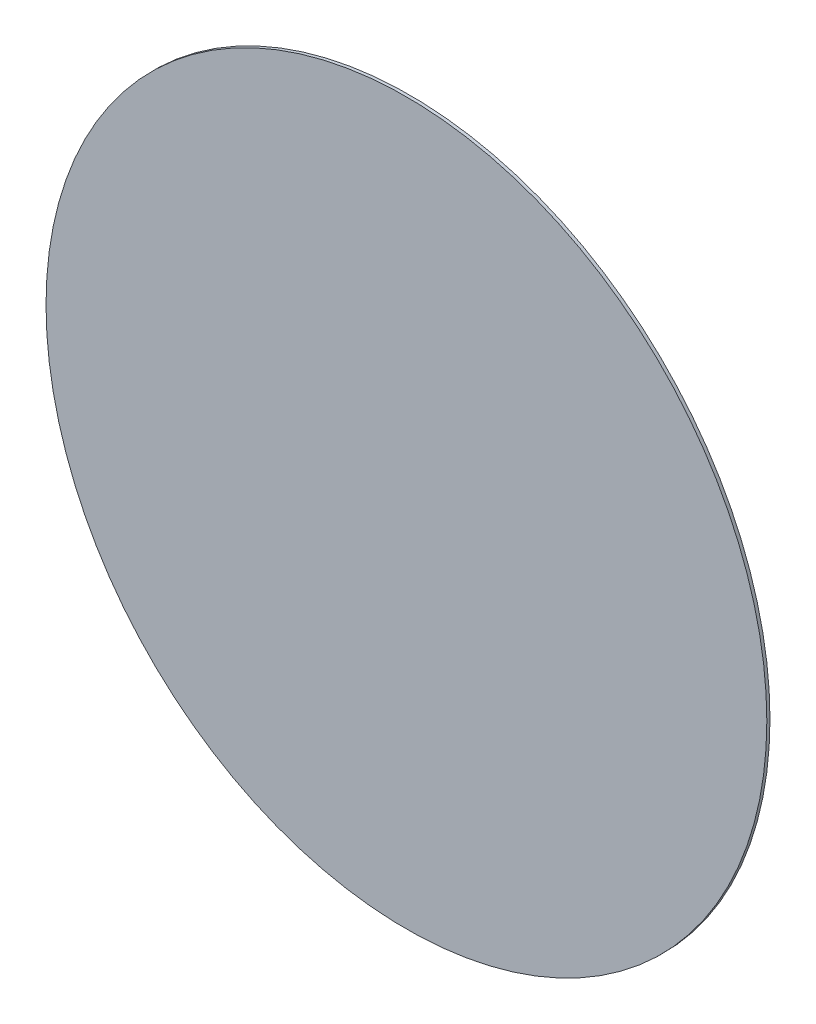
ISO-10303-21;
HEADER;
FILE_DESCRIPTION(('STEP AP214'),'2;1');
FILE_NAME('part.step','',(''),(''),'','','');
FILE_SCHEMA(('AUTOMOTIVE_DESIGN { 1 0 10303 214 1 1 1 1 }'));
ENDSEC;
DATA;
#1=APPLICATION_CONTEXT('core data for automotive mechanical design processes');
#2=APPLICATION_PROTOCOL_DEFINITION('international standard','automotive_design',2000,#1);
#3=PRODUCT_CONTEXT('',#1,'mechanical');
#4=PRODUCT('Part','Part','',(#3));
#5=PRODUCT_RELATED_PRODUCT_CATEGORY('part','',(#4));
#6=PRODUCT_DEFINITION_FORMATION('','',#4);
#7=PRODUCT_DEFINITION_CONTEXT('part definition',#1,'design');
#8=PRODUCT_DEFINITION('design','',#6,#7);
#9=PRODUCT_DEFINITION_SHAPE('','',#8);
#10=(LENGTH_UNIT() NAMED_UNIT(*) SI_UNIT(.MILLI.,.METRE.));
#11=(NAMED_UNIT(*) PLANE_ANGLE_UNIT() SI_UNIT($,.RADIAN.));
#12=(NAMED_UNIT(*) SI_UNIT($,.STERADIAN.) SOLID_ANGLE_UNIT());
#13=UNCERTAINTY_MEASURE_WITH_UNIT(LENGTH_MEASURE(1.E-05),#10,'distance_accuracy_value','');
#14=(GEOMETRIC_REPRESENTATION_CONTEXT(3) GLOBAL_UNCERTAINTY_ASSIGNED_CONTEXT((#13)) GLOBAL_UNIT_ASSIGNED_CONTEXT((#10,
#11,#12)) REPRESENTATION_CONTEXT('',''));
#15=CARTESIAN_POINT('',(0.,0.,0.));
#16=DIRECTION('',(0.,0.,1.));
#17=DIRECTION('',(1.,0.,0.));
#18=AXIS2_PLACEMENT_3D('',#15,#16,#17);
#19=CARTESIAN_POINT('',(0.,0.,0.10922));
#20=DIRECTION('',(0.,0.,-1.));
#21=DIRECTION('',(-1.,0.,0.));
#22=AXIS2_PLACEMENT_3D('',#19,#20,#21);
#23=CYLINDRICAL_SURFACE('',#22,12.5);
#24=CARTESIAN_POINT('',(0.,0.,0.10922));
#25=DIRECTION('',(0.,0.,1.));
#26=DIRECTION('',(1.,0.,0.));
#27=AXIS2_PLACEMENT_3D('',#24,#25,#26);
#28=CIRCLE('',#27,12.5);
#29=CARTESIAN_POINT('',(-12.5,0.,0.10922));
#30=VERTEX_POINT('',#29);
#31=EDGE_CURVE('E10',#30,#30,#28,.T.);
#32=CARTESIAN_POINT('',(0.,0.,0.));
#33=DIRECTION('',(0.,0.,1.));
#34=DIRECTION('',(1.,0.,0.));
#35=AXIS2_PLACEMENT_3D('',#32,#33,#34);
#36=CIRCLE('',#35,12.5);
#37=CARTESIAN_POINT('',(-12.5,0.,0.));
#38=VERTEX_POINT('',#37);
#39=EDGE_CURVE('E34',#38,#38,#36,.T.);
#40=CARTESIAN_POINT('',(-12.5,0.,0.10922));
#41=CARTESIAN_POINT('',(-12.5,0.,0.108082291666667));
#42=CARTESIAN_POINT('',(-12.5,0.,0.106944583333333));
#43=CARTESIAN_POINT('',(-12.5,0.,0.104669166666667));
#44=CARTESIAN_POINT('',(-12.5,0.,0.103531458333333));
#45=CARTESIAN_POINT('',(-12.5,0.,0.101256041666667));
#46=CARTESIAN_POINT('',(-12.5,0.,0.100118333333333));
#47=CARTESIAN_POINT('',(-12.5,0.,0.0978429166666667));
#48=CARTESIAN_POINT('',(-12.5,0.,0.0967052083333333));
#49=CARTESIAN_POINT('',(-12.5,0.,0.0944297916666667));
#50=CARTESIAN_POINT('',(-12.5,0.,0.0932920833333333));
#51=CARTESIAN_POINT('',(-12.5,0.,0.0910166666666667));
#52=CARTESIAN_POINT('',(-12.5,0.,0.0898789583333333));
#53=CARTESIAN_POINT('',(-12.5,0.,0.0876035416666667));
#54=CARTESIAN_POINT('',(-12.5,0.,0.0864658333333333));
#55=CARTESIAN_POINT('',(-12.5,0.,0.0841904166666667));
#56=CARTESIAN_POINT('',(-12.5,0.,0.0830527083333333));
#57=CARTESIAN_POINT('',(-12.5,0.,0.0807772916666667));
#58=CARTESIAN_POINT('',(-12.5,0.,0.0796395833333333));
#59=CARTESIAN_POINT('',(-12.5,0.,0.0773641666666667));
#60=CARTESIAN_POINT('',(-12.5,0.,0.0762264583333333));
#61=CARTESIAN_POINT('',(-12.5,0.,0.0739510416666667));
#62=CARTESIAN_POINT('',(-12.5,0.,0.0728133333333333));
#63=CARTESIAN_POINT('',(-12.5,0.,0.0705379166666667));
#64=CARTESIAN_POINT('',(-12.5,0.,0.0694002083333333));
#65=CARTESIAN_POINT('',(-12.5,0.,0.0671247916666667));
#66=CARTESIAN_POINT('',(-12.5,0.,0.0659870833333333));
#67=CARTESIAN_POINT('',(-12.5,0.,0.0637116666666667));
#68=CARTESIAN_POINT('',(-12.5,0.,0.0625739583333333));
#69=CARTESIAN_POINT('',(-12.5,0.,0.0602985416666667));
#70=CARTESIAN_POINT('',(-12.5,0.,0.0591608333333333));
#71=CARTESIAN_POINT('',(-12.5,0.,0.0568854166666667));
#72=CARTESIAN_POINT('',(-12.5,0.,0.0557477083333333));
#73=CARTESIAN_POINT('',(-12.5,0.,0.0534722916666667));
#74=CARTESIAN_POINT('',(-12.5,0.,0.0523345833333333));
#75=CARTESIAN_POINT('',(-12.5,0.,0.0500591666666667));
#76=CARTESIAN_POINT('',(-12.5,0.,0.0489214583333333));
#77=CARTESIAN_POINT('',(-12.5,0.,0.0466460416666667));
#78=CARTESIAN_POINT('',(-12.5,0.,0.0455083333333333));
#79=CARTESIAN_POINT('',(-12.5,0.,0.0432329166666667));
#80=CARTESIAN_POINT('',(-12.5,0.,0.0420952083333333));
#81=CARTESIAN_POINT('',(-12.5,0.,0.0398197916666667));
#82=CARTESIAN_POINT('',(-12.5,0.,0.0386820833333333));
#83=CARTESIAN_POINT('',(-12.5,0.,0.0364066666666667));
#84=CARTESIAN_POINT('',(-12.5,0.,0.0352689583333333));
#85=CARTESIAN_POINT('',(-12.5,0.,0.0329935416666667));
#86=CARTESIAN_POINT('',(-12.5,0.,0.0318558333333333));
#87=CARTESIAN_POINT('',(-12.5,0.,0.0295804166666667));
#88=CARTESIAN_POINT('',(-12.5,0.,0.0284427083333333));
#89=CARTESIAN_POINT('',(-12.5,0.,0.0261672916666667));
#90=CARTESIAN_POINT('',(-12.5,0.,0.0250295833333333));
#91=CARTESIAN_POINT('',(-12.5,0.,0.0227541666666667));
#92=CARTESIAN_POINT('',(-12.5,0.,0.0216164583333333));
#93=CARTESIAN_POINT('',(-12.5,0.,0.0193410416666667));
#94=CARTESIAN_POINT('',(-12.5,0.,0.0182033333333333));
#95=CARTESIAN_POINT('',(-12.5,0.,0.0159279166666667));
#96=CARTESIAN_POINT('',(-12.5,0.,0.0147902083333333));
#97=CARTESIAN_POINT('',(-12.5,0.,0.0125147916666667));
#98=CARTESIAN_POINT('',(-12.5,0.,0.0113770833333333));
#99=CARTESIAN_POINT('',(-12.5,0.,0.00910166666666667));
#100=CARTESIAN_POINT('',(-12.5,0.,0.00796395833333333));
#101=CARTESIAN_POINT('',(-12.5,0.,0.00568854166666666));
#102=CARTESIAN_POINT('',(-12.5,0.,0.00455083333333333));
#103=CARTESIAN_POINT('',(-12.5,0.,0.00227541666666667));
#104=CARTESIAN_POINT('',(-12.5,0.,0.00113770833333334));
#105=CARTESIAN_POINT('',(-12.5,0.,0.));
#106=B_SPLINE_CURVE_WITH_KNOTS('',3,(#40,#41,#42,#43,#44,#45,#46,#47,#48,#49,#50,#51,#52,#53,
#54,#55,#56,#57,#58,#59,#60,#61,#62,#63,#64,#65,#66,#67,#68,#69,#70,#71,#72,#73,#74,#75,#76,#77,
#78,#79,#80,#81,#82,#83,#84,#85,#86,#87,#88,#89,#90,#91,#92,#93,#94,#95,#96,#97,#98,#99,#100,
#101,#102,#103,#104,#105),.UNSPECIFIED.,.F.,.F.,(4,2,2,2,2,2,2,2,2,2,2,2,2,2,2,2,2,2,2,2,2,2,2,
2,2,2,2,2,2,2,2,2,4),(0.,0.003413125,0.00682625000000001,0.010239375,0.0136525,0.017065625,
0.02047875,0.023891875,0.027305,0.030718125,0.03413125,0.037544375,0.0409575,0.044370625,
0.04778375,0.051196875,0.05461,0.058023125,0.06143625,0.064849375,0.0682625,0.071675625,
0.07508875,0.078501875,0.081915,0.085328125,0.08874125,0.092154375,0.0955675,0.098980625,
0.10239375,0.105806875,0.10922),.UNSPECIFIED.);
#107=EDGE_CURVE('BSEAM28',#30,#38,#106,.T.);
#108=ORIENTED_EDGE('',*,*,#31,.F.);
#109=ORIENTED_EDGE('',*,*,#39,.T.);
#110=ORIENTED_EDGE('',*,*,#107,.T.);
#111=ORIENTED_EDGE('',*,*,#107,.F.);
#112=EDGE_LOOP('',(#108,#110,#109,#111));
#113=FACE_BOUND('',#112,.T.);
#114=ADVANCED_FACE('F28',(#113),#23,.T.);
#115=CARTESIAN_POINT('',(0.,0.,0.10922));
#116=DIRECTION('',(0.,0.,1.));
#117=DIRECTION('',(1.,0.,0.));
#118=AXIS2_PLACEMENT_3D('',#115,#116,#117);
#119=PLANE('',#118);
#120=ORIENTED_EDGE('',*,*,#31,.T.);
#121=EDGE_LOOP('',(#120));
#122=FACE_BOUND('',#121,.T.);
#123=ADVANCED_FACE('F43',(#122),#119,.T.);
#124=CARTESIAN_POINT('',(0.,0.,0.));
#125=DIRECTION('',(0.,0.,1.));
#126=DIRECTION('',(1.,0.,0.));
#127=AXIS2_PLACEMENT_3D('',#124,#125,#126);
#128=PLANE('',#127);
#129=ORIENTED_EDGE('',*,*,#39,.F.);
#130=EDGE_LOOP('',(#129));
#131=FACE_BOUND('',#130,.T.);
#132=ADVANCED_FACE('F41',(#131),#128,.F.);
#133=CLOSED_SHELL('',(#114,#123,#132));
#134=MANIFOLD_SOLID_BREP('B2',#133);
#135=ADVANCED_BREP_SHAPE_REPRESENTATION('',(#18,#134),#14);
#136=SHAPE_DEFINITION_REPRESENTATION(#9,#135);
ENDSEC;
END-ISO-10303-21;
